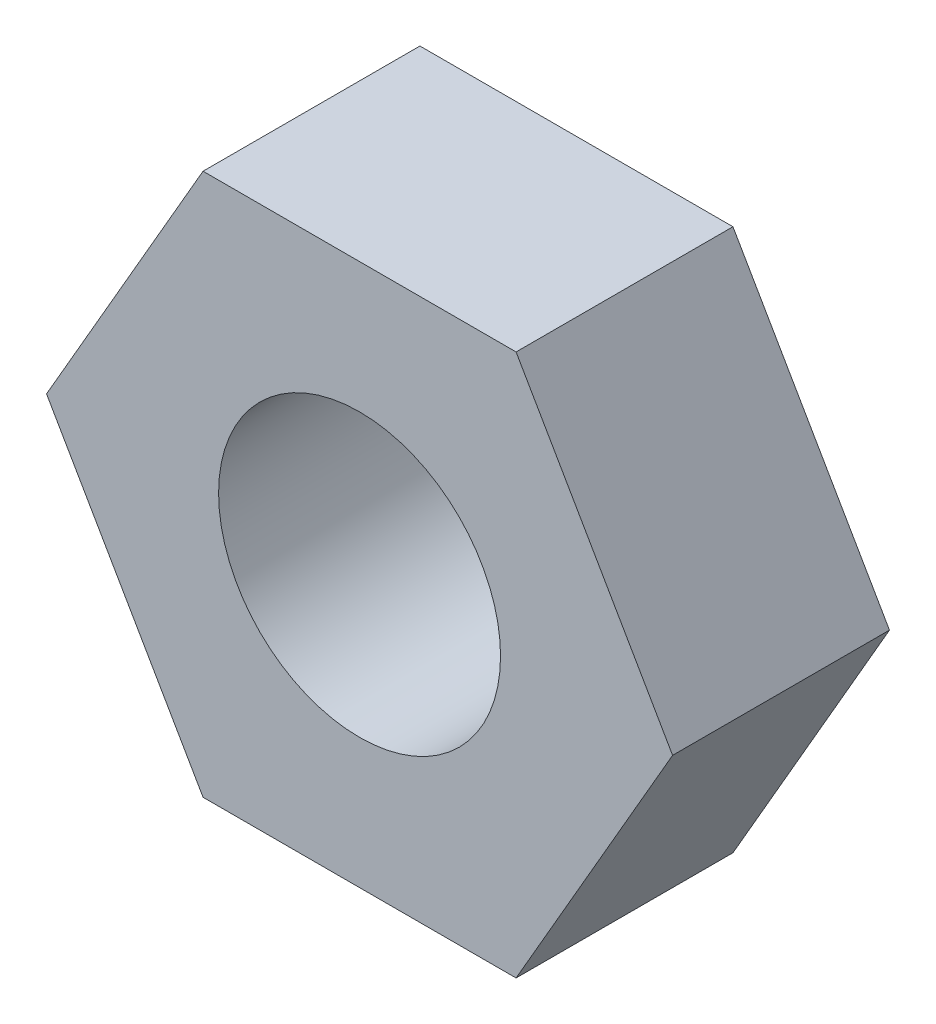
from build123d import *

# Parameters (mm, degrees)
SKETCH1_R           = 1.651
BOSS_EXTRUDE1_DEPTH = 2.54


with BuildPart() as part:
    # Sketch1 → Boss-Extrude1 (new body)
    with BuildSketch(Plane.XY):
        Polygon((3.666174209, 0), (1.833087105, 3.175), (-1.833087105, 3.175), (-3.666174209, 0), (-1.833087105, -3.175), (1.833087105, -3.175), align=None)
        Circle(SKETCH1_R, mode=Mode.SUBTRACT)
    extrude(amount=BOSS_EXTRUDE1_DEPTH)


solid = part.part
